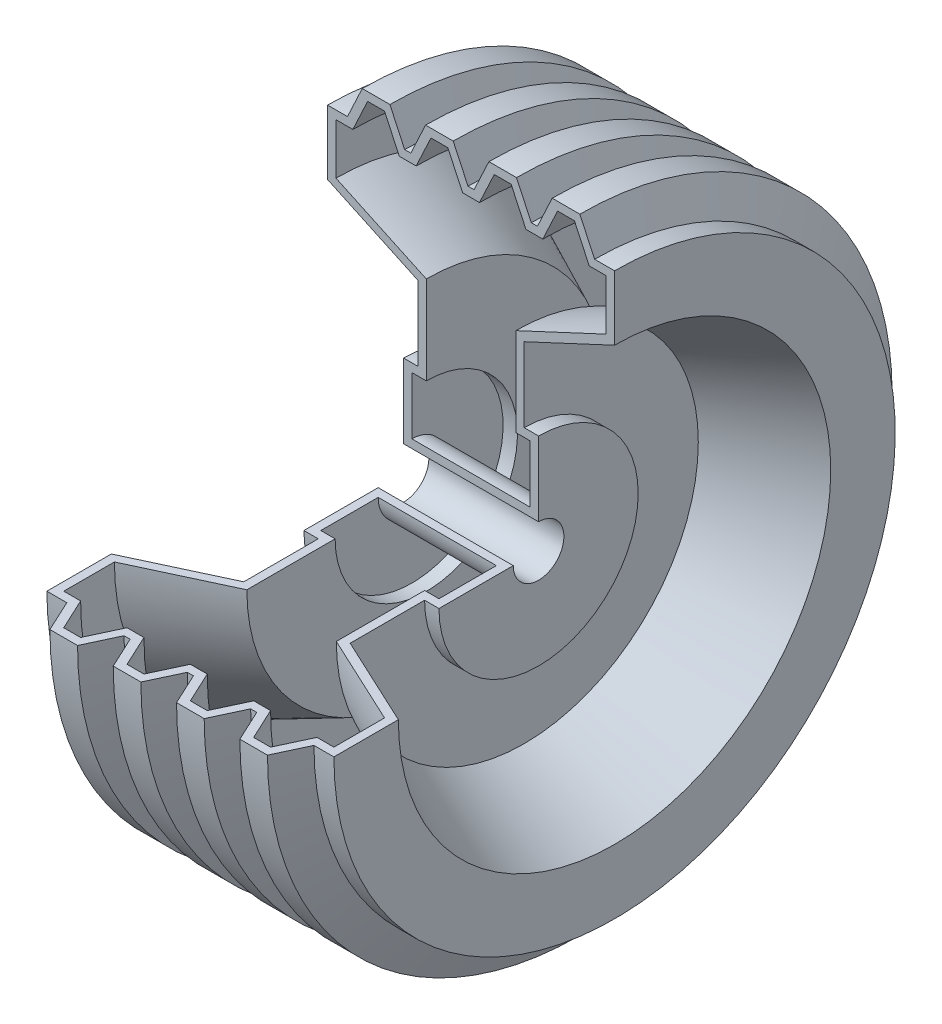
from build123d import *

# Parameters (mm, degrees)
REVOLVE_THIN1_ANGLE = 270


with BuildPart() as part:
    # Sketch1 → Revolve-Thin1 (revolve)
    with BuildSketch(Plane.XY):
        Polygon((1.814648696, 166.235564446), (10.564648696, 185), (26.935351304, 185), (35.685351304, 166.235564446), (39.314648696, 166.235564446), (48.064648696, 185), (64.435351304, 185), (73.185351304, 166.235564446), (85, 166.235564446), (85, 128.050213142), (31.5, 103.10275343), (31.5, 59), (40, 59), (40, 15), (-40, 15), (-40, 59), (-31.5, 59), (-31.5, 103.10275343), (-85, 128.050213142), (-85, 166.235564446), (-73.185351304, 166.235564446), (-64.435351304, 185), (-48.064648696, 185), (-39.314648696, 166.235564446), (-35.685351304, 166.235564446), (-26.935351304, 185), (-10.564648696, 185), (-1.814648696, 166.235564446), align=None)
        Polygon((5, 161.235564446), (13.75, 180), (23.75, 180), (32.5, 161.235564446), (42.5, 161.235564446), (51.25, 180), (61.25, 180), (70, 161.235564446), (80, 161.235564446), (80, 131.235564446), (26.5, 106.288104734), (26.5, 54), (35, 54), (35, 20), (-35, 20), (-35, 54), (-26.5, 54), (-26.5, 106.288104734), (-80, 131.235564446), (-80, 161.235564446), (-70, 161.235564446), (-61.25, 180), (-51.25, 180), (-42.5, 161.235564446), (-32.5, 161.235564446), (-23.75, 180), (-13.75, 180), (-5, 161.235564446), align=None, mode=Mode.SUBTRACT)
    revolve(axis=Axis((-70.763210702, 0, 0), (-1, 0, 0)), revolution_arc=REVOLVE_THIN1_ANGLE)


solid = part.part
